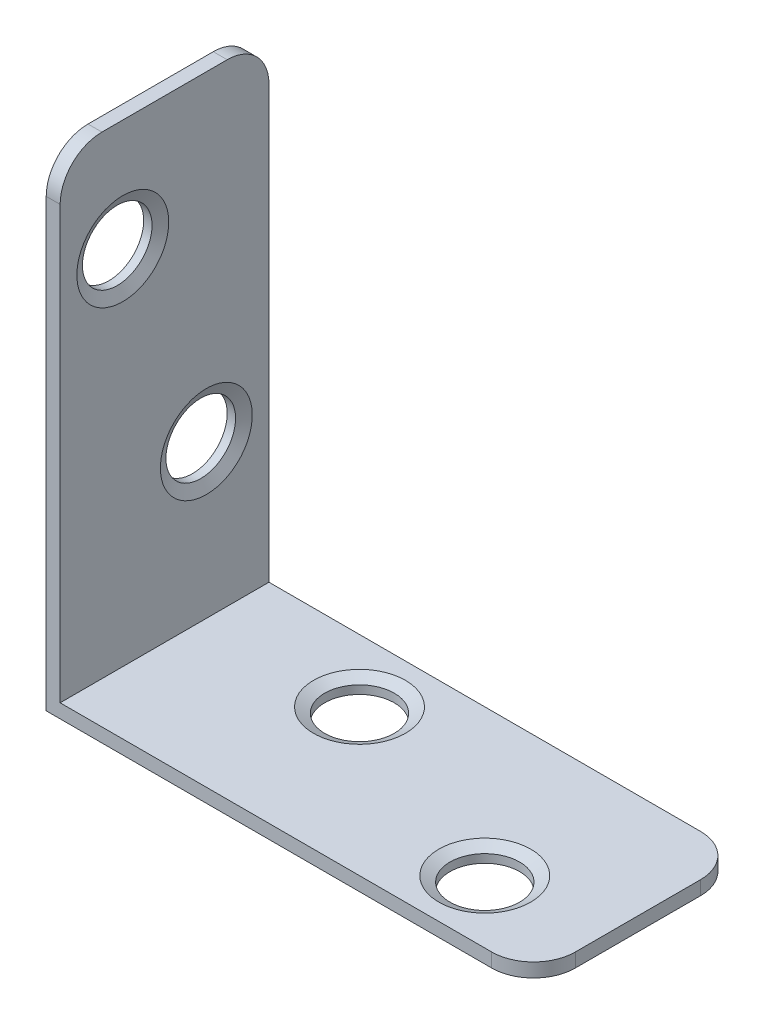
from build123d import *
from OCP.BRepFilletAPI import BRepFilletAPI_MakeChamfer

# Parameters (mm, degrees)
SALIENTE_EXTRUIR1_DEPTH = 7.5
REDONDEO1_R             = 3
CROQUIS2_R              = 2.5
CORTAR_EXTRUIR1_DEPTH   = 50.368512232
CHAFL_N1_SIZE           = 0.8
CHAFL_N1_SIZE2          = 0.4
CHAFL_N2_SIZE           = 0.4
CHAFL_N2_SIZE2          = 0.8


with BuildPart() as part:
    # Croquis1 → Saliente-Extruir1 (new, symmetric)
    with BuildSketch(Plane.XY):
        Polygon((0, 0), (0, 35), (1, 35), (1, 1), (35, 1), (35, 0), align=None)
    extrude(amount=SALIENTE_EXTRUIR1_DEPTH, both=True)

    # Redondeo1
    redondeo1_edges = [part.edges().sort_by_distance(p)[0] for p in [
        (0.5, 35, 7.5),
        (0.5, 35, -7.5),
        (35, 0.5, 7.5),
        (35, 0.5, -7.5),
    ]]
    fillet(redondeo1_edges, radius=REDONDEO1_R)

    # Croquis2 → Cortar-Extruir1 (cut, through all)
    with BuildSketch(Plane(origin=(1, 0, 0), x_dir=(0, 0, -1), z_dir=(1, 0, 0))):
        with Locations(Location((-3, 27, 0), (0, 0, 90))):
            Circle(CROQUIS2_R)
        with Locations(Location((3, 12, 0), (0, 0, 90))):
            Circle(CROQUIS2_R)
    cortar_extruir1 = extrude(amount=-CORTAR_EXTRUIR1_DEPTH, mode=Mode.SUBTRACT)

    # Simetr_a1: Cortar-Extruir1 across plane
    add(cortar_extruir1.mirror(Plane(origin=(0, 0, 0), x_dir=(0, 0, 1), z_dir=(-0.7071067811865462, 0.7071067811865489, 0))), mode=Mode.SUBTRACT)

    # Chafl_n1
    chafl_n1_edges = [part.edges().sort_by_distance(p)[0] for p in [
        (1, 24.5, 3),
        (1, 9.5, -3),
    ]]
    chafl_n1_side = [part.faces().sort_by_distance(p)[0] for p in [
        (1, 17.738716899, 0),
    ]]
    chamfer(chafl_n1_edges, length=CHAFL_N1_SIZE, length2=CHAFL_N1_SIZE2, reference=chafl_n1_side[0])

    # Chafl_n2: one chamfer whose edges measure the first distance from different faces: ONE call of the kernel's chamfer builder (chamfer() names one face for all edges)
    chafl_n2_edges_1 = [part.edges().sort_by_distance(p)[0] for p in [
        (24.5, 1, 3),
    ]]
    chafl_n2_side_1 = [part.faces().sort_by_distance(p)[0] for p in [
        (24.5, 0.5, 3),
    ]]
    chafl_n2_edges_2 = [part.edges().sort_by_distance(p)[0] for p in [
        (9.5, 1, -3),
    ]]
    chafl_n2_side_2 = [part.faces().sort_by_distance(p)[0] for p in [
        (9.5, 0.5, -3),
    ]]
    chafl_n2 = BRepFilletAPI_MakeChamfer(part.part.solid().wrapped)
    for e in chafl_n2_edges_1:
        chafl_n2.Add(CHAFL_N2_SIZE, CHAFL_N2_SIZE2, e.wrapped, chafl_n2_side_1[0].wrapped)  # the first distance lies on this face
    for e in chafl_n2_edges_2:
        chafl_n2.Add(CHAFL_N2_SIZE, CHAFL_N2_SIZE2, e.wrapped, chafl_n2_side_2[0].wrapped)  # the first distance lies on this face
    add(Compound.cast(chafl_n2.Shape()), mode=Mode.REPLACE)


solid = part.part
